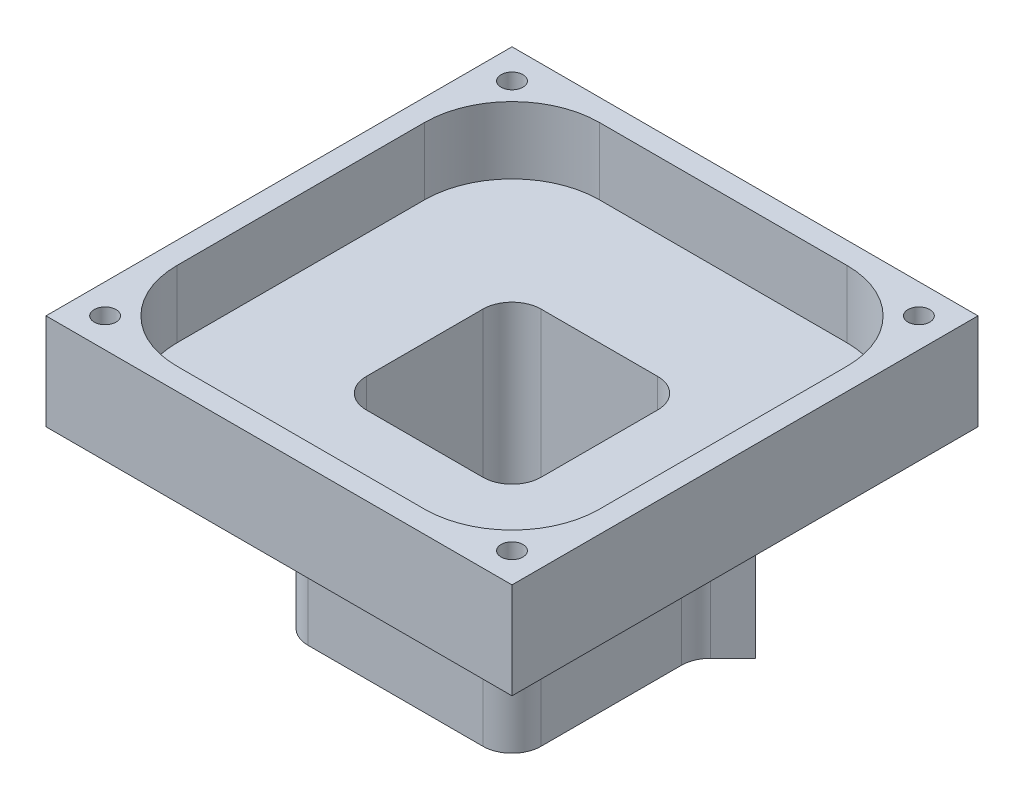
from build123d import *

# Parameters (mm, degrees)
SKETCH1_W                     = 8
SKETCH1_H                     = 8
BOSS_EXTRUDE1_DEPTH           = 6
SKETCH2_W                     = 16
SKETCH2_H                     = 16
BOSS_EXTRUDE2_DEPTH           = 3.3
SKETCH3_W                     = 6
SKETCH3_H                     = 6
CUT_EXTRUDE1_DEPTH            = 15.645477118
SKETCH6_W                     = 14.5
SKETCH6_H                     = 14.5
CUT_EXTRUDE3_DEPTH            = 2.3
FILLET1_R                     = 3
SKETCH11_R                    = 0.375
CUT_EXTRUDE7_DEPTH            = 15.645477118
BOSS_EXTRUDE3_REACH           = 16.645
FILLET4_R                     = 1
FILLET2_R                     = 1
TAP_DRILL_FOR_0_80_TAP1_D     = 1.19126
TAP_DRILL_FOR_0_80_TAP1_DEPTH = 7.11
TAP_DRILL_FOR_0_80_TAP1_TIP   = 0.357890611
FILLET5_R                     = 1


with BuildPart() as part:
    # Sketch1 → Boss-Extrude1 (new body)
    with BuildSketch(Plane(origin=(0, 0, 0), x_dir=(1, 0, 0), z_dir=(0, 1, 0))):
        Rectangle(SKETCH1_W, SKETCH1_H)
    extrude(amount=BOSS_EXTRUDE1_DEPTH)

    # Sketch2 → Boss-Extrude2 (add)
    with BuildSketch(Plane(origin=(0, 6, 0), x_dir=(1, 0, 0), z_dir=(0, 1, 0))):
        Rectangle(SKETCH2_W, SKETCH2_H)
    extrude(amount=BOSS_EXTRUDE2_DEPTH)

    # Sketch3 → Cut-Extrude1 (cut, through all)
    with BuildSketch(Plane.XZ):
        Rectangle(SKETCH3_W, SKETCH3_H)
    extrude(amount=-CUT_EXTRUDE1_DEPTH, mode=Mode.SUBTRACT)

    # Sketch6 → Cut-Extrude3 (cut)
    with BuildSketch(Plane(origin=(0, 9.3, 0), x_dir=(1, 0, 0), z_dir=(0, 1, 0))):
        Rectangle(SKETCH6_W, SKETCH6_H)
    extrude(amount=-CUT_EXTRUDE3_DEPTH, mode=Mode.SUBTRACT)

    # Fillet1
    fillet1_edges = [part.edges().sort_by_distance(p)[0] for p in [
        (-7.25, 8.15, 7.25),
        (-7.25, 8.15, -7.25),
        (7.25, 8.15, -7.25),
        (7.25, 8.15, 7.25),
    ]]
    fillet(fillet1_edges, radius=FILLET1_R)

    # Sketch11 → Cut-Extrude7 (cut, through all)
    with BuildSketch(Plane(origin=(0, 9.3, 0), x_dir=(1, 0, 0), z_dir=(0, 1, 0))):
        with Locations(Location((6.985, -6.985, 0), (0, 0, 270))):
            Circle(SKETCH11_R)
        with Locations(Location((6.985, 6.985, 0), (0, 0, 270))):
            Circle(SKETCH11_R)
        with Locations(Location((-6.985, 6.985, 0), (0, 0, 270))):
            Circle(SKETCH11_R)
        with Locations(Location((-6.985, -6.985, 0), (0, 0, 270))):
            Circle(SKETCH11_R)
    extrude(amount=-CUT_EXTRUDE7_DEPTH, mode=Mode.SUBTRACT)

    # Sketch12 → Boss-Extrude3 (add, up to next)
    with BuildSketch(Plane.XZ, mode=Mode.PRIVATE) as boss_extrude3_sk1:
        Polygon((5.060660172, -3.292893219), (4, -2.232233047), (2.232233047, -4), (3.292893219, -5.060660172), align=None)
    boss_extrude3_tool1 = extrude(boss_extrude3_sk1.sketch, amount=-BOSS_EXTRUDE3_REACH, mode=Mode.PRIVATE) - part.part
    add(boss_extrude3_tool1.solids().sort_by_distance((3.646447, 0, -3.646447))[0])

    # Fillet4
    fillet4_edges = [part.edges().sort_by_distance(p)[0] for p in [
        (-3, 3.5, 3),
        (3, 3.5, 3),
        (-3, 3.5, -3),
        (3, 3.5, -3),
    ]]
    fillet(fillet4_edges, radius=FILLET4_R)

    # Fillet2
    fillet2_edges = [part.edges().sort_by_distance(p)[0] for p in [
        (2.232233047, 3, -4),
        (4, 3, -2.232233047),
    ]]
    fillet(fillet2_edges, radius=FILLET2_R)

    # Tap Drill for _0-80 Tap1
    with Locations(Plane(origin=(4.176776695, 0, -4.176776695), x_dir=(-0.7071067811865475, 0, -0.7071067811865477), z_dir=(0.7071067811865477, 0, -0.7071067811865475))):
        with Locations((0, 1.25), (0, 3.25)):
            Hole(TAP_DRILL_FOR_0_80_TAP1_D / 2, depth=TAP_DRILL_FOR_0_80_TAP1_DEPTH)
            with Locations((0, 0, -(TAP_DRILL_FOR_0_80_TAP1_DEPTH + TAP_DRILL_FOR_0_80_TAP1_TIP / 2))):  # 118° drill point
                Cone(0, TAP_DRILL_FOR_0_80_TAP1_D / 2, TAP_DRILL_FOR_0_80_TAP1_TIP, mode=Mode.SUBTRACT)

    # Fillet5
    fillet5_edges = [part.edges().sort_by_distance(p)[0] for p in [
        (4, 3, 4),
        (-4, 3, 4),
        (-4, 3, -4),
    ]]
    fillet(fillet5_edges, radius=FILLET5_R)


solid = part.part
